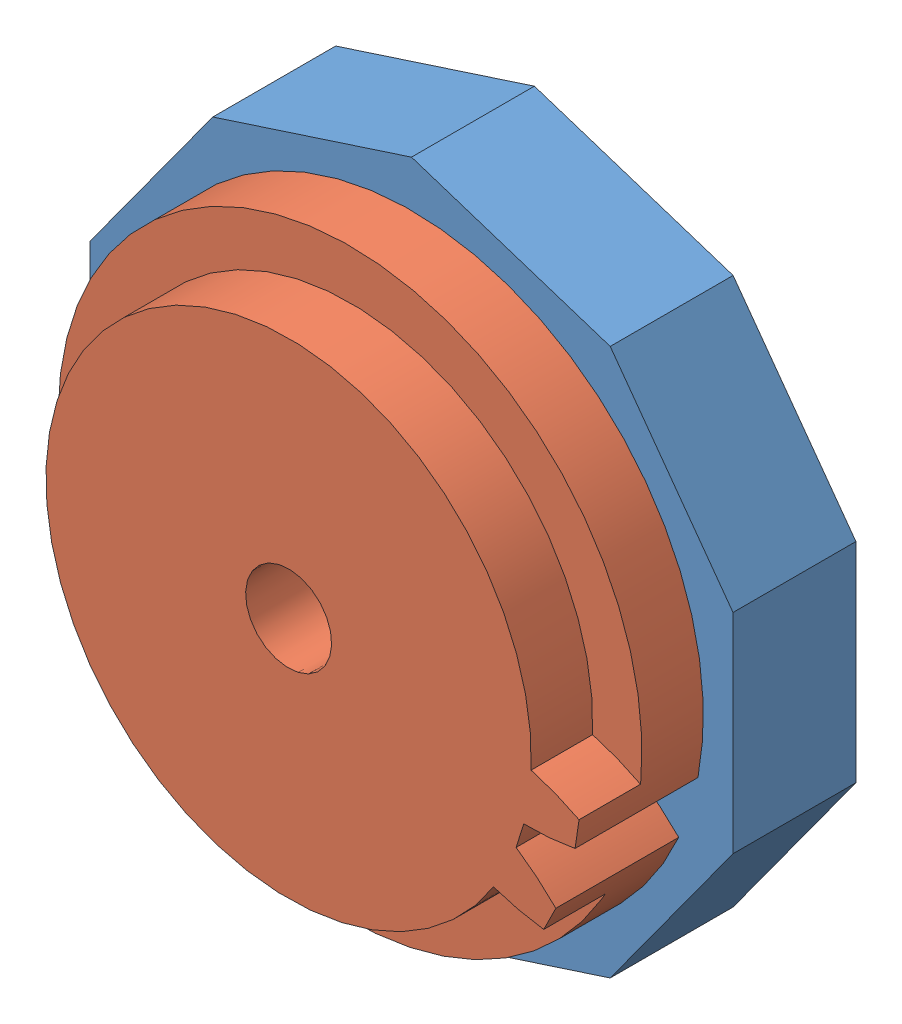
SolidWorks assembly 齒輪組3.SLDASM, configuration 預設 (file format 15000). Lengths in mm.
Overall size (118.78 118.97 40).
2 component instances, 2 part files, 2 mates.
Components (placement in the parent):
- 轉盤1-1: 轉盤1.SLDPRT [預設] at (-6.2404 -4.373 111.4183) size (104.64 110.03 20)
- 齒輪3-1: 齒輪3.SLDPRT [預設] at (8.5511 -9.0059 141.4183) x (-0.298898 -0.954285 0) z (0 0 1) size (95 94.71 20)
Mates (geometry in assembly coordinates):
- 同軸心1: concentric aligned: cylinder of 轉盤1-1 through (-6.2404 -4.373 131.4183) axis (0 0 -1) radius 6; cylinder of 齒輪3-1 through (-6.2404 -4.373 151.4183) axis (0 0 -1) radius 7
- 重合/共線/共點1: coincident anti-aligned: plane of 轉盤1-1 through (-6.2404 -4.373 131.4183) normal (0 0 1); plane of 齒輪3-1 through (1.2513 -27.8687 131.4183) normal (0 0 -1)
